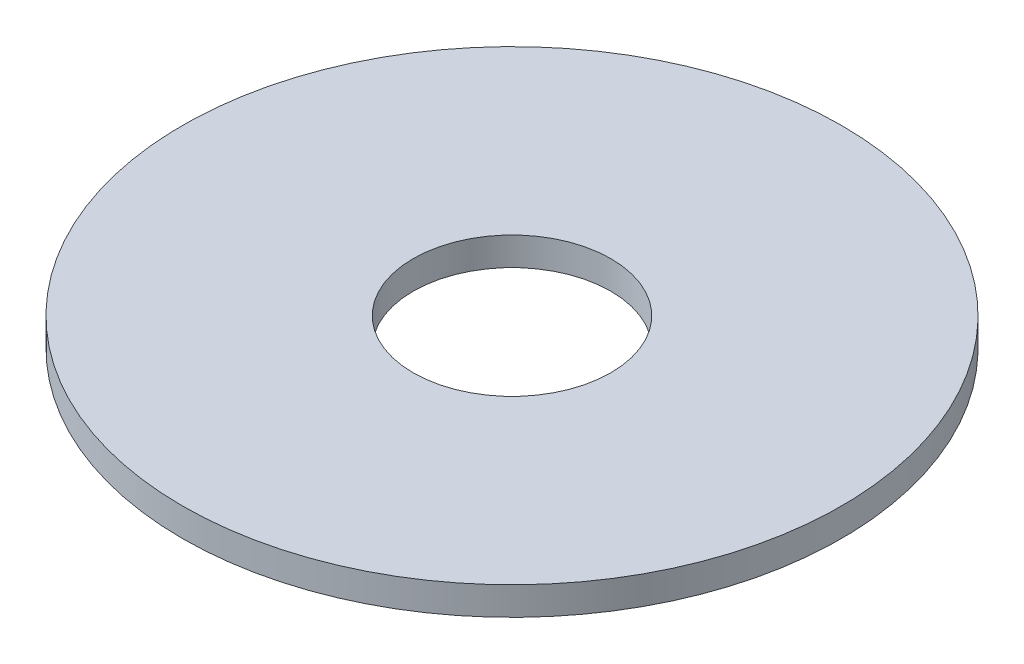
from build123d import *

# Parameters (mm, degrees)
ESQUISSE1_R      = 35
ESQUISSE1_R_2    = 10.5
EXTRUSION1_DEPTH = 3


with BuildPart() as part:
    # Esquisse1 → Extrusion1 (new body)
    with BuildSketch(Plane(origin=(0, 0, 0), x_dir=(1, 0, 0), z_dir=(0, 1, 0))):
        with Locations(Location((0, 0, 0), (0, 0, 270))):
            Circle(ESQUISSE1_R)
        with Locations(Location((0, 0, 0), (0, 0, 270))):
            Circle(ESQUISSE1_R_2, mode=Mode.SUBTRACT)
    extrude(amount=EXTRUSION1_DEPTH)


solid = part.part
